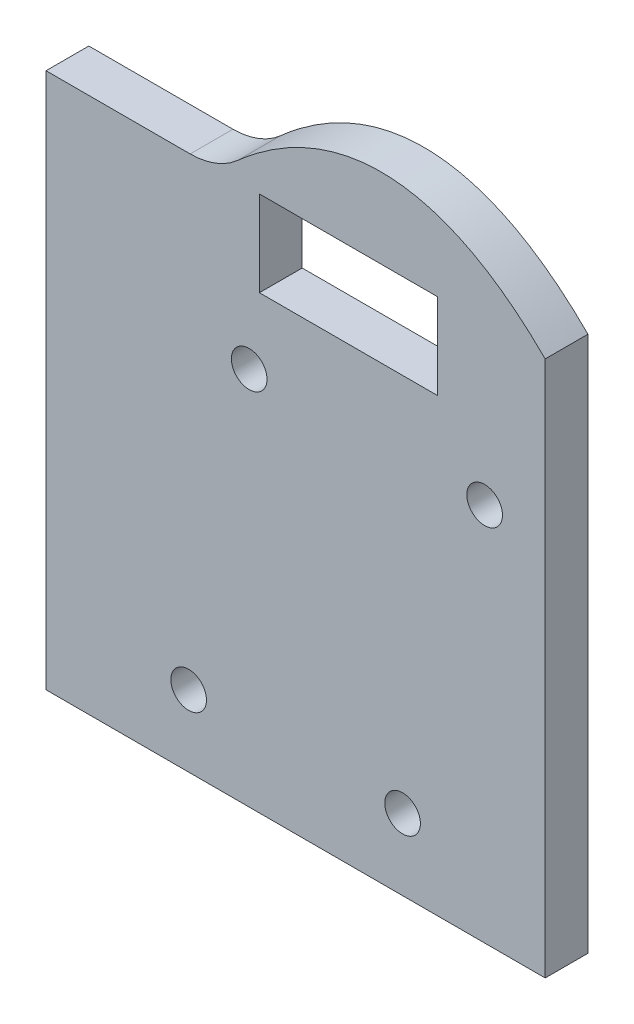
from build123d import *

# Parameters (mm, degrees)
SKETCH1_R           = 2.5
SKETCH1_W           = 24.999991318
SKETCH1_H           = 12
BOSS_EXTRUDE1_DEPTH = 6


with BuildPart() as part:
    # Sketch1 → Boss-Extrude1 (new body)
    with BuildSketch(Plane.XY):
        with BuildLine():
            Line((-201.971314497, 67.884414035), (-201.971314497, -7.301419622))
            Line((-201.971314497, -7.301419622), (-271.971337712, -7.301419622))
            Line((-271.971337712, -7.301419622), (-271.971290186, 67.884414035))
            Line((-271.971290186, 67.884414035), (-251.759596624, 67.884414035))
            ThreePointArc((-251.759596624, 67.884414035), (-248.210370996, 68.535457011), (-245.123285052, 70.403814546))
            add(Edge.make_bspline(
                [(-245.123285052, 70.403814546), (-231.216121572, 82.741364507), (-216.079648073, 81.959867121), (-201.971314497, 67.884414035)],
                knots=[0.059912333, 0.059912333, 0.059912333, 0.059912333, 1, 1, 1, 1], degree=3))
        make_face()
        with Locations((-221.971337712, 2.698580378)):
            Circle(SKETCH1_R, mode=Mode.SUBTRACT)
        with Locations(Location((-251.971314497, 2.698580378, 0), (0, 0, 180))):
            Circle(SKETCH1_R, mode=Mode.SUBTRACT)
        with Locations((-210.46205169, 45.896495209)):
            Circle(SKETCH1_R, mode=Mode.SUBTRACT)
        with Locations(Location((-243.480623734, 45.896495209, 0), (0, 0, 180))):
            Circle(SKETCH1_R, mode=Mode.SUBTRACT)
        with Locations((-229.544859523, 61.884414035)):
            Rectangle(SKETCH1_W, SKETCH1_H, mode=Mode.SUBTRACT)
    extrude(amount=BOSS_EXTRUDE1_DEPTH)


solid = part.part
